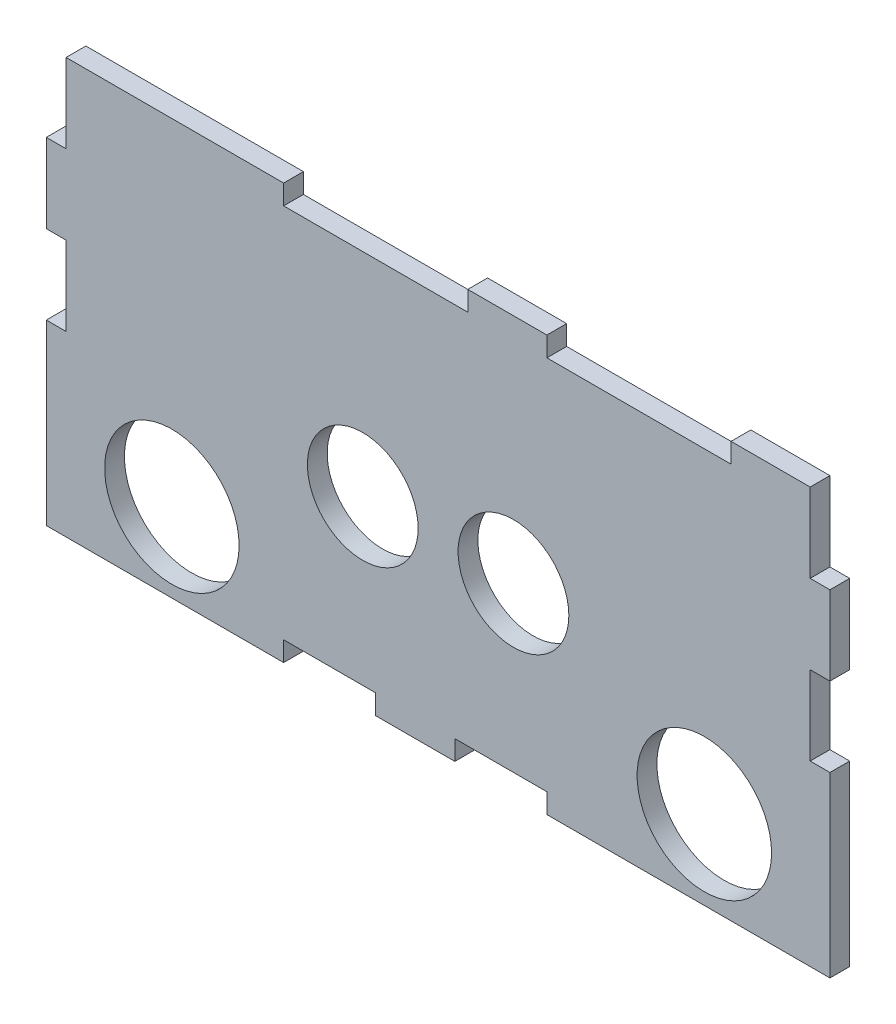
ISO-10303-21;
HEADER;
FILE_DESCRIPTION(('STEP AP214'),'2;1');
FILE_NAME('part.step','',(''),(''),'','','');
FILE_SCHEMA(('AUTOMOTIVE_DESIGN { 1 0 10303 214 1 1 1 1 }'));
ENDSEC;
DATA;
#1=APPLICATION_CONTEXT('core data for automotive mechanical design processes');
#2=APPLICATION_PROTOCOL_DEFINITION('international standard','automotive_design',2000,#1);
#3=PRODUCT_CONTEXT('',#1,'mechanical');
#4=PRODUCT('Part','Part','',(#3));
#5=PRODUCT_RELATED_PRODUCT_CATEGORY('part','',(#4));
#6=PRODUCT_DEFINITION_FORMATION('','',#4);
#7=PRODUCT_DEFINITION_CONTEXT('part definition',#1,'design');
#8=PRODUCT_DEFINITION('design','',#6,#7);
#9=PRODUCT_DEFINITION_SHAPE('','',#8);
#10=(LENGTH_UNIT() NAMED_UNIT(*) SI_UNIT(.MILLI.,.METRE.));
#11=(NAMED_UNIT(*) PLANE_ANGLE_UNIT() SI_UNIT($,.RADIAN.));
#12=(NAMED_UNIT(*) SI_UNIT($,.STERADIAN.) SOLID_ANGLE_UNIT());
#13=UNCERTAINTY_MEASURE_WITH_UNIT(LENGTH_MEASURE(1.E-05),#10,'distance_accuracy_value','');
#14=(GEOMETRIC_REPRESENTATION_CONTEXT(3) GLOBAL_UNCERTAINTY_ASSIGNED_CONTEXT((#13)) GLOBAL_UNIT_ASSIGNED_CONTEXT((#10,
#11,#12)) REPRESENTATION_CONTEXT('',''));
#15=CARTESIAN_POINT('',(0.,0.,0.));
#16=DIRECTION('',(0.,0.,1.));
#17=DIRECTION('',(1.,0.,0.));
#18=AXIS2_PLACEMENT_3D('',#15,#16,#17);
#19=CARTESIAN_POINT('',(0.,0.,5.));
#20=DIRECTION('',(0.,0.,1.));
#21=DIRECTION('',(1.,0.,0.));
#22=AXIS2_PLACEMENT_3D('',#19,#20,#21);
#23=PLANE('',#22);
#24=CARTESIAN_POINT('',(118.11,46.3812888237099,5.));
#25=DIRECTION('',(0.,0.,1.));
#26=DIRECTION('',(1.,0.,0.));
#27=AXIS2_PLACEMENT_3D('',#24,#25,#26);
#28=CIRCLE('',#27,14.);
#29=CARTESIAN_POINT('',(132.11,46.3812888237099,5.));
#30=VERTEX_POINT('',#29);
#31=EDGE_CURVE('E557',#30,#30,#28,.T.);
#32=ORIENTED_EDGE('',*,*,#31,.F.);
#33=EDGE_LOOP('',(#32));
#34=FACE_BOUND('',#33,.T.);
#35=CARTESIAN_POINT('',(31.75,20.,5.));
#36=DIRECTION('',(0.,0.,1.));
#37=DIRECTION('',(1.,0.,0.));
#38=AXIS2_PLACEMENT_3D('',#35,#36,#37);
#39=CIRCLE('',#38,17.);
#40=CARTESIAN_POINT('',(48.75,20.,5.));
#41=VERTEX_POINT('',#40);
#42=EDGE_CURVE('E284',#41,#41,#39,.T.);
#43=ORIENTED_EDGE('',*,*,#42,.F.);
#44=EDGE_LOOP('',(#43));
#45=FACE_BOUND('',#44,.T.);
#46=DIRECTION('',(1.,0.,0.));
#47=VECTOR('',#46,1.);
#48=CARTESIAN_POINT('',(0.,0.,5.));
#49=LINE('',#48,#47);
#50=CARTESIAN_POINT('',(0.,0.,5.));
#51=VERTEX_POINT('',#50);
#52=CARTESIAN_POINT('',(60.,0.,5.));
#53=VERTEX_POINT('',#52);
#54=EDGE_CURVE('E343',#51,#53,#49,.T.);
#55=ORIENTED_EDGE('',*,*,#54,.T.);
#56=DIRECTION('',(0.,1.,0.));
#57=VECTOR('',#56,1.);
#58=CARTESIAN_POINT('',(60.,0.,5.));
#59=LINE('',#58,#57);
#60=CARTESIAN_POINT('',(60.,5.,5.));
#61=VERTEX_POINT('',#60);
#62=EDGE_CURVE('E171',#53,#61,#59,.T.);
#63=ORIENTED_EDGE('',*,*,#62,.T.);
#64=DIRECTION('',(1.,0.,0.));
#65=VECTOR('',#64,1.);
#66=CARTESIAN_POINT('',(60.,5.,5.));
#67=LINE('',#66,#65);
#68=CARTESIAN_POINT('',(83.28,5.,5.));
#69=VERTEX_POINT('',#68);
#70=EDGE_CURVE('E430',#61,#69,#67,.T.);
#71=ORIENTED_EDGE('',*,*,#70,.T.);
#72=DIRECTION('',(0.,-1.,0.));
#73=VECTOR('',#72,1.);
#74=CARTESIAN_POINT('',(83.28,5.,5.));
#75=LINE('',#74,#73);
#76=CARTESIAN_POINT('',(83.28,0.,5.));
#77=VERTEX_POINT('',#76);
#78=EDGE_CURVE('E449',#69,#77,#75,.T.);
#79=ORIENTED_EDGE('',*,*,#78,.T.);
#80=DIRECTION('',(1.,0.,0.));
#81=VECTOR('',#80,1.);
#82=CARTESIAN_POINT('',(83.28,0.,5.));
#83=LINE('',#82,#81);
#84=CARTESIAN_POINT('',(103.28,0.,5.));
#85=VERTEX_POINT('',#84);
#86=EDGE_CURVE('E446',#77,#85,#83,.T.);
#87=ORIENTED_EDGE('',*,*,#86,.T.);
#88=DIRECTION('',(0.,1.,0.));
#89=VECTOR('',#88,1.);
#90=CARTESIAN_POINT('',(103.28,0.,5.));
#91=LINE('',#90,#89);
#92=CARTESIAN_POINT('',(103.28,5.,5.));
#93=VERTEX_POINT('',#92);
#94=EDGE_CURVE('E448',#85,#93,#91,.T.);
#95=ORIENTED_EDGE('',*,*,#94,.T.);
#96=DIRECTION('',(1.,0.,0.));
#97=VECTOR('',#96,1.);
#98=CARTESIAN_POINT('',(103.28,5.,5.));
#99=LINE('',#98,#97);
#100=CARTESIAN_POINT('',(126.56,5.,5.));
#101=VERTEX_POINT('',#100);
#102=EDGE_CURVE('E451',#93,#101,#99,.T.);
#103=ORIENTED_EDGE('',*,*,#102,.T.);
#104=DIRECTION('',(0.,-1.,0.));
#105=VECTOR('',#104,1.);
#106=CARTESIAN_POINT('',(126.56,5.,5.));
#107=LINE('',#106,#105);
#108=CARTESIAN_POINT('',(126.56,0.,5.));
#109=VERTEX_POINT('',#108);
#110=EDGE_CURVE('E457',#101,#109,#107,.T.);
#111=ORIENTED_EDGE('',*,*,#110,.T.);
#112=DIRECTION('',(1.,0.,0.));
#113=VECTOR('',#112,1.);
#114=CARTESIAN_POINT('',(126.56,0.,5.));
#115=LINE('',#114,#113);
#116=CARTESIAN_POINT('',(198.12,0.,5.));
#117=VERTEX_POINT('',#116);
#118=EDGE_CURVE('E459',#109,#117,#115,.T.);
#119=ORIENTED_EDGE('',*,*,#118,.T.);
#120=DIRECTION('',(0.,1.,0.));
#121=VECTOR('',#120,1.);
#122=CARTESIAN_POINT('',(198.12,45.,5.));
#123=LINE('',#122,#121);
#124=CARTESIAN_POINT('',(198.12,45.,5.));
#125=VERTEX_POINT('',#124);
#126=EDGE_CURVE('E461',#117,#125,#123,.T.);
#127=ORIENTED_EDGE('',*,*,#126,.T.);
#128=DIRECTION('',(-1.,0.,0.));
#129=VECTOR('',#128,1.);
#130=CARTESIAN_POINT('',(193.12,45.,5.));
#131=LINE('',#130,#129);
#132=CARTESIAN_POINT('',(193.12,45.,5.));
#133=VERTEX_POINT('',#132);
#134=EDGE_CURVE('E463',#125,#133,#131,.T.);
#135=ORIENTED_EDGE('',*,*,#134,.T.);
#136=DIRECTION('',(0.,1.,0.));
#137=VECTOR('',#136,1.);
#138=CARTESIAN_POINT('',(193.12,65.,5.));
#139=LINE('',#138,#137);
#140=CARTESIAN_POINT('',(193.12,65.,5.));
#141=VERTEX_POINT('',#140);
#142=EDGE_CURVE('E465',#133,#141,#139,.T.);
#143=ORIENTED_EDGE('',*,*,#142,.T.);
#144=DIRECTION('',(1.,0.,0.));
#145=VECTOR('',#144,1.);
#146=CARTESIAN_POINT('',(198.12,65.,5.));
#147=LINE('',#146,#145);
#148=CARTESIAN_POINT('',(198.12,65.,5.));
#149=VERTEX_POINT('',#148);
#150=EDGE_CURVE('E467',#141,#149,#147,.T.);
#151=ORIENTED_EDGE('',*,*,#150,.T.);
#152=DIRECTION('',(0.,1.,0.));
#153=VECTOR('',#152,1.);
#154=CARTESIAN_POINT('',(198.12,85.,5.));
#155=LINE('',#154,#153);
#156=CARTESIAN_POINT('',(198.12,85.,5.));
#157=VERTEX_POINT('',#156);
#158=EDGE_CURVE('E469',#149,#157,#155,.T.);
#159=ORIENTED_EDGE('',*,*,#158,.T.);
#160=DIRECTION('',(-1.,0.,0.));
#161=VECTOR('',#160,1.);
#162=CARTESIAN_POINT('',(193.12,85.,5.));
#163=LINE('',#162,#161);
#164=CARTESIAN_POINT('',(193.12,85.,5.));
#165=VERTEX_POINT('',#164);
#166=EDGE_CURVE('E471',#157,#165,#163,.T.);
#167=ORIENTED_EDGE('',*,*,#166,.T.);
#168=DIRECTION('',(0.,1.,0.));
#169=VECTOR('',#168,1.);
#170=CARTESIAN_POINT('',(193.12,105.,5.));
#171=LINE('',#170,#169);
#172=CARTESIAN_POINT('',(193.12,105.,5.));
#173=VERTEX_POINT('',#172);
#174=EDGE_CURVE('E473',#165,#173,#171,.T.);
#175=ORIENTED_EDGE('',*,*,#174,.T.);
#176=DIRECTION('',(-1.,0.,0.));
#177=VECTOR('',#176,1.);
#178=CARTESIAN_POINT('',(173.12,105.,5.));
#179=LINE('',#178,#177);
#180=CARTESIAN_POINT('',(173.12,105.,5.));
#181=VERTEX_POINT('',#180);
#182=EDGE_CURVE('E475',#173,#181,#179,.T.);
#183=ORIENTED_EDGE('',*,*,#182,.T.);
#184=DIRECTION('',(0.,-1.,0.));
#185=VECTOR('',#184,1.);
#186=CARTESIAN_POINT('',(173.12,100.,5.));
#187=LINE('',#186,#185);
#188=CARTESIAN_POINT('',(173.12,100.,5.));
#189=VERTEX_POINT('',#188);
#190=EDGE_CURVE('E477',#181,#189,#187,.T.);
#191=ORIENTED_EDGE('',*,*,#190,.T.);
#192=DIRECTION('',(-1.,0.,0.));
#193=VECTOR('',#192,1.);
#194=CARTESIAN_POINT('',(126.56,100.,5.));
#195=LINE('',#194,#193);
#196=CARTESIAN_POINT('',(126.56,100.,5.));
#197=VERTEX_POINT('',#196);
#198=EDGE_CURVE('E479',#189,#197,#195,.T.);
#199=ORIENTED_EDGE('',*,*,#198,.T.);
#200=DIRECTION('',(0.,1.,0.));
#201=VECTOR('',#200,1.);
#202=CARTESIAN_POINT('',(126.56,105.,5.));
#203=LINE('',#202,#201);
#204=CARTESIAN_POINT('',(126.56,105.,5.));
#205=VERTEX_POINT('',#204);
#206=EDGE_CURVE('E481',#197,#205,#203,.T.);
#207=ORIENTED_EDGE('',*,*,#206,.T.);
#208=DIRECTION('',(-1.,0.,0.));
#209=VECTOR('',#208,1.);
#210=CARTESIAN_POINT('',(106.56,105.,5.));
#211=LINE('',#210,#209);
#212=CARTESIAN_POINT('',(106.56,105.,5.));
#213=VERTEX_POINT('',#212);
#214=EDGE_CURVE('E483',#205,#213,#211,.T.);
#215=ORIENTED_EDGE('',*,*,#214,.T.);
#216=DIRECTION('',(0.,-1.,0.));
#217=VECTOR('',#216,1.);
#218=CARTESIAN_POINT('',(106.56,100.,5.));
#219=LINE('',#218,#217);
#220=CARTESIAN_POINT('',(106.56,100.,5.));
#221=VERTEX_POINT('',#220);
#222=EDGE_CURVE('E485',#213,#221,#219,.T.);
#223=ORIENTED_EDGE('',*,*,#222,.T.);
#224=DIRECTION('',(-1.,0.,0.));
#225=VECTOR('',#224,1.);
#226=CARTESIAN_POINT('',(60.,100.,5.));
#227=LINE('',#226,#225);
#228=CARTESIAN_POINT('',(60.,100.,5.));
#229=VERTEX_POINT('',#228);
#230=EDGE_CURVE('E487',#221,#229,#227,.T.);
#231=ORIENTED_EDGE('',*,*,#230,.T.);
#232=DIRECTION('',(0.,1.,0.));
#233=VECTOR('',#232,1.);
#234=CARTESIAN_POINT('',(60.,105.,5.));
#235=LINE('',#234,#233);
#236=CARTESIAN_POINT('',(60.,105.,5.));
#237=VERTEX_POINT('',#236);
#238=EDGE_CURVE('E489',#229,#237,#235,.T.);
#239=ORIENTED_EDGE('',*,*,#238,.T.);
#240=DIRECTION('',(-1.,0.,0.));
#241=VECTOR('',#240,1.);
#242=CARTESIAN_POINT('',(5.,105.,5.));
#243=LINE('',#242,#241);
#244=CARTESIAN_POINT('',(5.,105.,5.));
#245=VERTEX_POINT('',#244);
#246=EDGE_CURVE('E491',#237,#245,#243,.T.);
#247=ORIENTED_EDGE('',*,*,#246,.T.);
#248=DIRECTION('',(0.,-1.,0.));
#249=VECTOR('',#248,1.);
#250=CARTESIAN_POINT('',(5.,85.,5.));
#251=LINE('',#250,#249);
#252=CARTESIAN_POINT('',(5.,85.,5.));
#253=VERTEX_POINT('',#252);
#254=EDGE_CURVE('E493',#245,#253,#251,.T.);
#255=ORIENTED_EDGE('',*,*,#254,.T.);
#256=DIRECTION('',(-1.,0.,0.));
#257=VECTOR('',#256,1.);
#258=CARTESIAN_POINT('',(0.,85.,5.));
#259=LINE('',#258,#257);
#260=CARTESIAN_POINT('',(0.,85.,5.));
#261=VERTEX_POINT('',#260);
#262=EDGE_CURVE('E495',#253,#261,#259,.T.);
#263=ORIENTED_EDGE('',*,*,#262,.T.);
#264=DIRECTION('',(0.,-1.,0.));
#265=VECTOR('',#264,1.);
#266=CARTESIAN_POINT('',(0.,65.,5.));
#267=LINE('',#266,#265);
#268=CARTESIAN_POINT('',(0.,65.,5.));
#269=VERTEX_POINT('',#268);
#270=EDGE_CURVE('E497',#261,#269,#267,.T.);
#271=ORIENTED_EDGE('',*,*,#270,.T.);
#272=DIRECTION('',(1.,0.,0.));
#273=VECTOR('',#272,1.);
#274=CARTESIAN_POINT('',(5.,65.,5.));
#275=LINE('',#274,#273);
#276=CARTESIAN_POINT('',(5.,65.,5.));
#277=VERTEX_POINT('',#276);
#278=EDGE_CURVE('E262',#269,#277,#275,.T.);
#279=ORIENTED_EDGE('',*,*,#278,.T.);
#280=DIRECTION('',(0.,-1.,0.));
#281=VECTOR('',#280,1.);
#282=CARTESIAN_POINT('',(5.,45.,5.));
#283=LINE('',#282,#281);
#284=CARTESIAN_POINT('',(5.,45.,5.));
#285=VERTEX_POINT('',#284);
#286=EDGE_CURVE('E256',#277,#285,#283,.T.);
#287=ORIENTED_EDGE('',*,*,#286,.T.);
#288=DIRECTION('',(-1.,0.,0.));
#289=VECTOR('',#288,1.);
#290=CARTESIAN_POINT('',(0.,45.,5.));
#291=LINE('',#290,#289);
#292=CARTESIAN_POINT('',(0.,45.,5.));
#293=VERTEX_POINT('',#292);
#294=EDGE_CURVE('E260',#285,#293,#291,.T.);
#295=ORIENTED_EDGE('',*,*,#294,.T.);
#296=DIRECTION('',(0.,-1.,0.));
#297=VECTOR('',#296,1.);
#298=CARTESIAN_POINT('',(0.,0.,5.));
#299=LINE('',#298,#297);
#300=EDGE_CURVE('E56',#293,#51,#299,.T.);
#301=ORIENTED_EDGE('',*,*,#300,.T.);
#302=EDGE_LOOP('',(#55,#63,#71,#79,#87,#95,#103,#111,#119,#127,#135,#143,#151,#159,#167,#175,
#183,#191,#199,#207,#215,#223,#231,#239,#247,#255,#263,#271,#279,#287,#295,#301));
#303=FACE_BOUND('',#302,.T.);
#304=CARTESIAN_POINT('',(80.01,46.3812888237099,5.));
#305=DIRECTION('',(0.,0.,1.));
#306=DIRECTION('',(1.,0.,0.));
#307=AXIS2_PLACEMENT_3D('',#304,#305,#306);
#308=CIRCLE('',#307,14.);
#309=CARTESIAN_POINT('',(94.01,46.3812888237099,5.));
#310=VERTEX_POINT('',#309);
#311=EDGE_CURVE('E563',#310,#310,#308,.T.);
#312=ORIENTED_EDGE('',*,*,#311,.F.);
#313=EDGE_LOOP('',(#312));
#314=FACE_BOUND('',#313,.T.);
#315=CARTESIAN_POINT('',(166.37,20.,5.));
#316=DIRECTION('',(0.,0.,1.));
#317=DIRECTION('',(1.,0.,0.));
#318=AXIS2_PLACEMENT_3D('',#315,#316,#317);
#319=CIRCLE('',#318,17.);
#320=CARTESIAN_POINT('',(183.37,20.,5.));
#321=VERTEX_POINT('',#320);
#322=EDGE_CURVE('E548',#321,#321,#319,.T.);
#323=ORIENTED_EDGE('',*,*,#322,.F.);
#324=EDGE_LOOP('',(#323));
#325=FACE_BOUND('',#324,.T.);
#326=ADVANCED_FACE('F39',(#34,#45,#303,#314,#325),#23,.T.);
#327=CARTESIAN_POINT('',(0.,0.,0.));
#328=DIRECTION('',(0.,0.,1.));
#329=DIRECTION('',(1.,0.,0.));
#330=AXIS2_PLACEMENT_3D('',#327,#328,#329);
#331=PLANE('',#330);
#332=DIRECTION('',(1.,0.,0.));
#333=VECTOR('',#332,1.);
#334=CARTESIAN_POINT('',(0.,0.,0.));
#335=LINE('',#334,#333);
#336=CARTESIAN_POINT('',(0.,0.,0.));
#337=VERTEX_POINT('',#336);
#338=CARTESIAN_POINT('',(60.,0.,0.));
#339=VERTEX_POINT('',#338);
#340=EDGE_CURVE('E280',#337,#339,#335,.T.);
#341=ORIENTED_EDGE('',*,*,#340,.F.);
#342=DIRECTION('',(0.,-1.,0.));
#343=VECTOR('',#342,1.);
#344=CARTESIAN_POINT('',(0.,0.,0.));
#345=LINE('',#344,#343);
#346=CARTESIAN_POINT('',(0.,45.,0.));
#347=VERTEX_POINT('',#346);
#348=EDGE_CURVE('E163',#347,#337,#345,.T.);
#349=ORIENTED_EDGE('',*,*,#348,.F.);
#350=DIRECTION('',(-1.,0.,0.));
#351=VECTOR('',#350,1.);
#352=CARTESIAN_POINT('',(0.,45.,0.));
#353=LINE('',#352,#351);
#354=CARTESIAN_POINT('',(5.,45.,0.));
#355=VERTEX_POINT('',#354);
#356=EDGE_CURVE('E157',#355,#347,#353,.T.);
#357=ORIENTED_EDGE('',*,*,#356,.F.);
#358=DIRECTION('',(0.,-1.,0.));
#359=VECTOR('',#358,1.);
#360=CARTESIAN_POINT('',(5.,45.,0.));
#361=LINE('',#360,#359);
#362=CARTESIAN_POINT('',(5.,65.,0.));
#363=VERTEX_POINT('',#362);
#364=EDGE_CURVE('E270',#363,#355,#361,.T.);
#365=ORIENTED_EDGE('',*,*,#364,.F.);
#366=DIRECTION('',(1.,0.,0.));
#367=VECTOR('',#366,1.);
#368=CARTESIAN_POINT('',(5.,65.,0.));
#369=LINE('',#368,#367);
#370=CARTESIAN_POINT('',(0.,65.,0.));
#371=VERTEX_POINT('',#370);
#372=EDGE_CURVE('E338',#371,#363,#369,.T.);
#373=ORIENTED_EDGE('',*,*,#372,.F.);
#374=DIRECTION('',(0.,-1.,0.));
#375=VECTOR('',#374,1.);
#376=CARTESIAN_POINT('',(0.,65.,0.));
#377=LINE('',#376,#375);
#378=CARTESIAN_POINT('',(0.,85.,0.));
#379=VERTEX_POINT('',#378);
#380=EDGE_CURVE('E336',#379,#371,#377,.T.);
#381=ORIENTED_EDGE('',*,*,#380,.F.);
#382=DIRECTION('',(-1.,0.,0.));
#383=VECTOR('',#382,1.);
#384=CARTESIAN_POINT('',(0.,85.,0.));
#385=LINE('',#384,#383);
#386=CARTESIAN_POINT('',(5.,85.,0.));
#387=VERTEX_POINT('',#386);
#388=EDGE_CURVE('E334',#387,#379,#385,.T.);
#389=ORIENTED_EDGE('',*,*,#388,.F.);
#390=DIRECTION('',(0.,-1.,0.));
#391=VECTOR('',#390,1.);
#392=CARTESIAN_POINT('',(5.,85.,0.));
#393=LINE('',#392,#391);
#394=CARTESIAN_POINT('',(5.,105.,0.));
#395=VERTEX_POINT('',#394);
#396=EDGE_CURVE('E332',#395,#387,#393,.T.);
#397=ORIENTED_EDGE('',*,*,#396,.F.);
#398=DIRECTION('',(-1.,0.,0.));
#399=VECTOR('',#398,1.);
#400=CARTESIAN_POINT('',(5.,105.,0.));
#401=LINE('',#400,#399);
#402=CARTESIAN_POINT('',(60.,105.,0.));
#403=VERTEX_POINT('',#402);
#404=EDGE_CURVE('E330',#403,#395,#401,.T.);
#405=ORIENTED_EDGE('',*,*,#404,.F.);
#406=DIRECTION('',(0.,1.,0.));
#407=VECTOR('',#406,1.);
#408=CARTESIAN_POINT('',(60.,105.,0.));
#409=LINE('',#408,#407);
#410=CARTESIAN_POINT('',(60.,100.,0.));
#411=VERTEX_POINT('',#410);
#412=EDGE_CURVE('E328',#411,#403,#409,.T.);
#413=ORIENTED_EDGE('',*,*,#412,.F.);
#414=DIRECTION('',(-1.,0.,0.));
#415=VECTOR('',#414,1.);
#416=CARTESIAN_POINT('',(60.,100.,0.));
#417=LINE('',#416,#415);
#418=CARTESIAN_POINT('',(106.56,100.,0.));
#419=VERTEX_POINT('',#418);
#420=EDGE_CURVE('E326',#419,#411,#417,.T.);
#421=ORIENTED_EDGE('',*,*,#420,.F.);
#422=DIRECTION('',(0.,-1.,0.));
#423=VECTOR('',#422,1.);
#424=CARTESIAN_POINT('',(106.56,100.,0.));
#425=LINE('',#424,#423);
#426=CARTESIAN_POINT('',(106.56,105.,0.));
#427=VERTEX_POINT('',#426);
#428=EDGE_CURVE('E324',#427,#419,#425,.T.);
#429=ORIENTED_EDGE('',*,*,#428,.F.);
#430=DIRECTION('',(-1.,0.,0.));
#431=VECTOR('',#430,1.);
#432=CARTESIAN_POINT('',(106.56,105.,0.));
#433=LINE('',#432,#431);
#434=CARTESIAN_POINT('',(126.56,105.,0.));
#435=VERTEX_POINT('',#434);
#436=EDGE_CURVE('E322',#435,#427,#433,.T.);
#437=ORIENTED_EDGE('',*,*,#436,.F.);
#438=DIRECTION('',(0.,1.,0.));
#439=VECTOR('',#438,1.);
#440=CARTESIAN_POINT('',(126.56,105.,0.));
#441=LINE('',#440,#439);
#442=CARTESIAN_POINT('',(126.56,100.,0.));
#443=VERTEX_POINT('',#442);
#444=EDGE_CURVE('E320',#443,#435,#441,.T.);
#445=ORIENTED_EDGE('',*,*,#444,.F.);
#446=DIRECTION('',(-1.,0.,0.));
#447=VECTOR('',#446,1.);
#448=CARTESIAN_POINT('',(126.56,100.,0.));
#449=LINE('',#448,#447);
#450=CARTESIAN_POINT('',(173.12,100.,0.));
#451=VERTEX_POINT('',#450);
#452=EDGE_CURVE('E318',#451,#443,#449,.T.);
#453=ORIENTED_EDGE('',*,*,#452,.F.);
#454=DIRECTION('',(0.,-1.,0.));
#455=VECTOR('',#454,1.);
#456=CARTESIAN_POINT('',(173.12,100.,0.));
#457=LINE('',#456,#455);
#458=CARTESIAN_POINT('',(173.12,105.,0.));
#459=VERTEX_POINT('',#458);
#460=EDGE_CURVE('E316',#459,#451,#457,.T.);
#461=ORIENTED_EDGE('',*,*,#460,.F.);
#462=DIRECTION('',(-1.,0.,0.));
#463=VECTOR('',#462,1.);
#464=CARTESIAN_POINT('',(173.12,105.,0.));
#465=LINE('',#464,#463);
#466=CARTESIAN_POINT('',(193.12,105.,0.));
#467=VERTEX_POINT('',#466);
#468=EDGE_CURVE('E314',#467,#459,#465,.T.);
#469=ORIENTED_EDGE('',*,*,#468,.F.);
#470=DIRECTION('',(0.,1.,0.));
#471=VECTOR('',#470,1.);
#472=CARTESIAN_POINT('',(193.12,105.,0.));
#473=LINE('',#472,#471);
#474=CARTESIAN_POINT('',(193.12,85.,0.));
#475=VERTEX_POINT('',#474);
#476=EDGE_CURVE('E312',#475,#467,#473,.T.);
#477=ORIENTED_EDGE('',*,*,#476,.F.);
#478=DIRECTION('',(-1.,0.,0.));
#479=VECTOR('',#478,1.);
#480=CARTESIAN_POINT('',(193.12,85.,0.));
#481=LINE('',#480,#479);
#482=CARTESIAN_POINT('',(198.12,85.,0.));
#483=VERTEX_POINT('',#482);
#484=EDGE_CURVE('E310',#483,#475,#481,.T.);
#485=ORIENTED_EDGE('',*,*,#484,.F.);
#486=DIRECTION('',(0.,1.,0.));
#487=VECTOR('',#486,1.);
#488=CARTESIAN_POINT('',(198.12,85.,0.));
#489=LINE('',#488,#487);
#490=CARTESIAN_POINT('',(198.12,65.,0.));
#491=VERTEX_POINT('',#490);
#492=EDGE_CURVE('E308',#491,#483,#489,.T.);
#493=ORIENTED_EDGE('',*,*,#492,.F.);
#494=DIRECTION('',(1.,0.,0.));
#495=VECTOR('',#494,1.);
#496=CARTESIAN_POINT('',(198.12,65.,0.));
#497=LINE('',#496,#495);
#498=CARTESIAN_POINT('',(193.12,65.,0.));
#499=VERTEX_POINT('',#498);
#500=EDGE_CURVE('E306',#499,#491,#497,.T.);
#501=ORIENTED_EDGE('',*,*,#500,.F.);
#502=DIRECTION('',(0.,1.,0.));
#503=VECTOR('',#502,1.);
#504=CARTESIAN_POINT('',(193.12,65.,0.));
#505=LINE('',#504,#503);
#506=CARTESIAN_POINT('',(193.12,45.,0.));
#507=VERTEX_POINT('',#506);
#508=EDGE_CURVE('E304',#507,#499,#505,.T.);
#509=ORIENTED_EDGE('',*,*,#508,.F.);
#510=DIRECTION('',(-1.,0.,0.));
#511=VECTOR('',#510,1.);
#512=CARTESIAN_POINT('',(193.12,45.,0.));
#513=LINE('',#512,#511);
#514=CARTESIAN_POINT('',(198.12,45.,0.));
#515=VERTEX_POINT('',#514);
#516=EDGE_CURVE('E302',#515,#507,#513,.T.);
#517=ORIENTED_EDGE('',*,*,#516,.F.);
#518=DIRECTION('',(0.,1.,0.));
#519=VECTOR('',#518,1.);
#520=CARTESIAN_POINT('',(198.12,45.,0.));
#521=LINE('',#520,#519);
#522=CARTESIAN_POINT('',(198.12,0.,0.));
#523=VERTEX_POINT('',#522);
#524=EDGE_CURVE('E300',#523,#515,#521,.T.);
#525=ORIENTED_EDGE('',*,*,#524,.F.);
#526=DIRECTION('',(1.,0.,0.));
#527=VECTOR('',#526,1.);
#528=CARTESIAN_POINT('',(126.56,0.,0.));
#529=LINE('',#528,#527);
#530=CARTESIAN_POINT('',(126.56,0.,0.));
#531=VERTEX_POINT('',#530);
#532=EDGE_CURVE('E298',#531,#523,#529,.T.);
#533=ORIENTED_EDGE('',*,*,#532,.F.);
#534=DIRECTION('',(0.,-1.,0.));
#535=VECTOR('',#534,1.);
#536=CARTESIAN_POINT('',(126.56,5.,0.));
#537=LINE('',#536,#535);
#538=CARTESIAN_POINT('',(126.56,5.,0.));
#539=VERTEX_POINT('',#538);
#540=EDGE_CURVE('E296',#539,#531,#537,.T.);
#541=ORIENTED_EDGE('',*,*,#540,.F.);
#542=DIRECTION('',(1.,0.,0.));
#543=VECTOR('',#542,1.);
#544=CARTESIAN_POINT('',(103.28,5.,0.));
#545=LINE('',#544,#543);
#546=CARTESIAN_POINT('',(103.28,5.,0.));
#547=VERTEX_POINT('',#546);
#548=EDGE_CURVE('E294',#547,#539,#545,.T.);
#549=ORIENTED_EDGE('',*,*,#548,.F.);
#550=DIRECTION('',(0.,1.,0.));
#551=VECTOR('',#550,1.);
#552=CARTESIAN_POINT('',(103.28,0.,0.));
#553=LINE('',#552,#551);
#554=CARTESIAN_POINT('',(103.28,0.,0.));
#555=VERTEX_POINT('',#554);
#556=EDGE_CURVE('E292',#555,#547,#553,.T.);
#557=ORIENTED_EDGE('',*,*,#556,.F.);
#558=DIRECTION('',(1.,0.,0.));
#559=VECTOR('',#558,1.);
#560=CARTESIAN_POINT('',(83.28,0.,0.));
#561=LINE('',#560,#559);
#562=CARTESIAN_POINT('',(83.28,0.,0.));
#563=VERTEX_POINT('',#562);
#564=EDGE_CURVE('E290',#563,#555,#561,.T.);
#565=ORIENTED_EDGE('',*,*,#564,.F.);
#566=DIRECTION('',(0.,-1.,0.));
#567=VECTOR('',#566,1.);
#568=CARTESIAN_POINT('',(83.28,5.,0.));
#569=LINE('',#568,#567);
#570=CARTESIAN_POINT('',(83.28,5.,0.));
#571=VERTEX_POINT('',#570);
#572=EDGE_CURVE('E288',#571,#563,#569,.T.);
#573=ORIENTED_EDGE('',*,*,#572,.F.);
#574=DIRECTION('',(1.,0.,0.));
#575=VECTOR('',#574,1.);
#576=CARTESIAN_POINT('',(60.,5.,0.));
#577=LINE('',#576,#575);
#578=CARTESIAN_POINT('',(60.,5.,0.));
#579=VERTEX_POINT('',#578);
#580=EDGE_CURVE('E286',#579,#571,#577,.T.);
#581=ORIENTED_EDGE('',*,*,#580,.F.);
#582=DIRECTION('',(0.,1.,0.));
#583=VECTOR('',#582,1.);
#584=CARTESIAN_POINT('',(60.,0.,0.));
#585=LINE('',#584,#583);
#586=EDGE_CURVE('E283',#339,#579,#585,.T.);
#587=ORIENTED_EDGE('',*,*,#586,.F.);
#588=EDGE_LOOP('',(#341,#349,#357,#365,#373,#381,#389,#397,#405,#413,#421,#429,#437,#445,#453,
#461,#469,#477,#485,#493,#501,#509,#517,#525,#533,#541,#549,#557,#565,#573,#581,#587));
#589=FACE_BOUND('',#588,.T.);
#590=CARTESIAN_POINT('',(31.75,20.,0.));
#591=DIRECTION('',(0.,0.,1.));
#592=DIRECTION('',(1.,0.,0.));
#593=AXIS2_PLACEMENT_3D('',#590,#591,#592);
#594=CIRCLE('',#593,17.);
#595=CARTESIAN_POINT('',(48.75,20.,0.));
#596=VERTEX_POINT('',#595);
#597=EDGE_CURVE('E566',#596,#596,#594,.T.);
#598=ORIENTED_EDGE('',*,*,#597,.T.);
#599=EDGE_LOOP('',(#598));
#600=FACE_BOUND('',#599,.T.);
#601=CARTESIAN_POINT('',(80.01,46.3812888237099,0.));
#602=DIRECTION('',(0.,0.,1.));
#603=DIRECTION('',(1.,0.,0.));
#604=AXIS2_PLACEMENT_3D('',#601,#602,#603);
#605=CIRCLE('',#604,14.);
#606=CARTESIAN_POINT('',(94.01,46.3812888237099,0.));
#607=VERTEX_POINT('',#606);
#608=EDGE_CURVE('E560',#607,#607,#605,.T.);
#609=ORIENTED_EDGE('',*,*,#608,.T.);
#610=EDGE_LOOP('',(#609));
#611=FACE_BOUND('',#610,.T.);
#612=CARTESIAN_POINT('',(118.11,46.3812888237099,0.));
#613=DIRECTION('',(0.,0.,1.));
#614=DIRECTION('',(1.,0.,0.));
#615=AXIS2_PLACEMENT_3D('',#612,#613,#614);
#616=CIRCLE('',#615,14.);
#617=CARTESIAN_POINT('',(132.11,46.3812888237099,0.));
#618=VERTEX_POINT('',#617);
#619=EDGE_CURVE('E554',#618,#618,#616,.T.);
#620=ORIENTED_EDGE('',*,*,#619,.T.);
#621=EDGE_LOOP('',(#620));
#622=FACE_BOUND('',#621,.T.);
#623=CARTESIAN_POINT('',(166.37,20.,0.));
#624=DIRECTION('',(0.,0.,1.));
#625=DIRECTION('',(1.,0.,0.));
#626=AXIS2_PLACEMENT_3D('',#623,#624,#625);
#627=CIRCLE('',#626,17.);
#628=CARTESIAN_POINT('',(183.37,20.,0.));
#629=VERTEX_POINT('',#628);
#630=EDGE_CURVE('E551',#629,#629,#627,.T.);
#631=ORIENTED_EDGE('',*,*,#630,.T.);
#632=EDGE_LOOP('',(#631));
#633=FACE_BOUND('',#632,.T.);
#634=ADVANCED_FACE('F434',(#589,#600,#611,#622,#633),#331,.F.);
#635=CARTESIAN_POINT('',(0.,0.,5.));
#636=DIRECTION('',(0.,1.,0.));
#637=DIRECTION('',(0.,0.,1.));
#638=AXIS2_PLACEMENT_3D('',#635,#636,#637);
#639=PLANE('',#638);
#640=ORIENTED_EDGE('',*,*,#340,.T.);
#641=DIRECTION('',(0.,0.,-1.));
#642=VECTOR('',#641,1.);
#643=CARTESIAN_POINT('',(60.,0.,5.));
#644=LINE('',#643,#642);
#645=EDGE_CURVE('E11',#53,#339,#644,.T.);
#646=ORIENTED_EDGE('',*,*,#645,.F.);
#647=ORIENTED_EDGE('',*,*,#54,.F.);
#648=DIRECTION('',(0.,0.,-1.));
#649=VECTOR('',#648,1.);
#650=CARTESIAN_POINT('',(0.,0.,5.));
#651=LINE('',#650,#649);
#652=EDGE_CURVE('E276',#51,#337,#651,.T.);
#653=ORIENTED_EDGE('',*,*,#652,.T.);
#654=EDGE_LOOP('',(#640,#646,#647,#653));
#655=FACE_BOUND('',#654,.T.);
#656=ADVANCED_FACE('F41',(#655),#639,.F.);
#657=CARTESIAN_POINT('',(60.,0.,5.));
#658=DIRECTION('',(-1.,0.,0.));
#659=DIRECTION('',(0.,0.,1.));
#660=AXIS2_PLACEMENT_3D('',#657,#658,#659);
#661=PLANE('',#660);
#662=ORIENTED_EDGE('',*,*,#586,.T.);
#663=DIRECTION('',(0.,0.,-1.));
#664=VECTOR('',#663,1.);
#665=CARTESIAN_POINT('',(60.,5.,5.));
#666=LINE('',#665,#664);
#667=EDGE_CURVE('E48',#61,#579,#666,.T.);
#668=ORIENTED_EDGE('',*,*,#667,.F.);
#669=ORIENTED_EDGE('',*,*,#62,.F.);
#670=ORIENTED_EDGE('',*,*,#645,.T.);
#671=EDGE_LOOP('',(#662,#668,#669,#670));
#672=FACE_BOUND('',#671,.T.);
#673=ADVANCED_FACE('F906',(#672),#661,.F.);
#674=CARTESIAN_POINT('',(60.,5.,5.));
#675=DIRECTION('',(0.,1.,0.));
#676=DIRECTION('',(0.,0.,1.));
#677=AXIS2_PLACEMENT_3D('',#674,#675,#676);
#678=PLANE('',#677);
#679=ORIENTED_EDGE('',*,*,#580,.T.);
#680=DIRECTION('',(0.,0.,-1.));
#681=VECTOR('',#680,1.);
#682=CARTESIAN_POINT('',(83.28,5.,5.));
#683=LINE('',#682,#681);
#684=EDGE_CURVE('E422',#69,#571,#683,.T.);
#685=ORIENTED_EDGE('',*,*,#684,.F.);
#686=ORIENTED_EDGE('',*,*,#70,.F.);
#687=ORIENTED_EDGE('',*,*,#667,.T.);
#688=EDGE_LOOP('',(#679,#685,#686,#687));
#689=FACE_BOUND('',#688,.T.);
#690=ADVANCED_FACE('F428',(#689),#678,.F.);
#691=CARTESIAN_POINT('',(83.28,5.,5.));
#692=DIRECTION('',(1.,0.,0.));
#693=DIRECTION('',(0.,0.,-1.));
#694=AXIS2_PLACEMENT_3D('',#691,#692,#693);
#695=PLANE('',#694);
#696=ORIENTED_EDGE('',*,*,#572,.T.);
#697=DIRECTION('',(0.,0.,-1.));
#698=VECTOR('',#697,1.);
#699=CARTESIAN_POINT('',(83.28,0.,5.));
#700=LINE('',#699,#698);
#701=EDGE_CURVE('E419',#77,#563,#700,.T.);
#702=ORIENTED_EDGE('',*,*,#701,.F.);
#703=ORIENTED_EDGE('',*,*,#78,.F.);
#704=ORIENTED_EDGE('',*,*,#684,.T.);
#705=EDGE_LOOP('',(#696,#702,#703,#704));
#706=FACE_BOUND('',#705,.T.);
#707=ADVANCED_FACE('F440',(#706),#695,.F.);
#708=CARTESIAN_POINT('',(83.28,0.,5.));
#709=DIRECTION('',(0.,1.,0.));
#710=DIRECTION('',(0.,0.,1.));
#711=AXIS2_PLACEMENT_3D('',#708,#709,#710);
#712=PLANE('',#711);
#713=ORIENTED_EDGE('',*,*,#564,.T.);
#714=DIRECTION('',(0.,0.,-1.));
#715=VECTOR('',#714,1.);
#716=CARTESIAN_POINT('',(103.28,0.,5.));
#717=LINE('',#716,#715);
#718=EDGE_CURVE('E416',#85,#555,#717,.T.);
#719=ORIENTED_EDGE('',*,*,#718,.F.);
#720=ORIENTED_EDGE('',*,*,#86,.F.);
#721=ORIENTED_EDGE('',*,*,#701,.T.);
#722=EDGE_LOOP('',(#713,#719,#720,#721));
#723=FACE_BOUND('',#722,.T.);
#724=ADVANCED_FACE('F444',(#723),#712,.F.);
#725=CARTESIAN_POINT('',(103.28,0.,5.));
#726=DIRECTION('',(-1.,0.,0.));
#727=DIRECTION('',(0.,0.,1.));
#728=AXIS2_PLACEMENT_3D('',#725,#726,#727);
#729=PLANE('',#728);
#730=ORIENTED_EDGE('',*,*,#556,.T.);
#731=DIRECTION('',(0.,0.,-1.));
#732=VECTOR('',#731,1.);
#733=CARTESIAN_POINT('',(103.28,5.,5.));
#734=LINE('',#733,#732);
#735=EDGE_CURVE('E413',#93,#547,#734,.T.);
#736=ORIENTED_EDGE('',*,*,#735,.F.);
#737=ORIENTED_EDGE('',*,*,#94,.F.);
#738=ORIENTED_EDGE('',*,*,#718,.T.);
#739=EDGE_LOOP('',(#730,#736,#737,#738));
#740=FACE_BOUND('',#739,.T.);
#741=ADVANCED_FACE('F867',(#740),#729,.F.);
#742=CARTESIAN_POINT('',(103.28,5.,5.));
#743=DIRECTION('',(0.,1.,0.));
#744=DIRECTION('',(0.,0.,1.));
#745=AXIS2_PLACEMENT_3D('',#742,#743,#744);
#746=PLANE('',#745);
#747=ORIENTED_EDGE('',*,*,#548,.T.);
#748=DIRECTION('',(0.,0.,-1.));
#749=VECTOR('',#748,1.);
#750=CARTESIAN_POINT('',(126.56,5.,5.));
#751=LINE('',#750,#749);
#752=EDGE_CURVE('E410',#101,#539,#751,.T.);
#753=ORIENTED_EDGE('',*,*,#752,.F.);
#754=ORIENTED_EDGE('',*,*,#102,.F.);
#755=ORIENTED_EDGE('',*,*,#735,.T.);
#756=EDGE_LOOP('',(#747,#753,#754,#755));
#757=FACE_BOUND('',#756,.T.);
#758=ADVANCED_FACE('F856',(#757),#746,.F.);
#759=CARTESIAN_POINT('',(126.56,5.,5.));
#760=DIRECTION('',(1.,0.,0.));
#761=DIRECTION('',(0.,0.,-1.));
#762=AXIS2_PLACEMENT_3D('',#759,#760,#761);
#763=PLANE('',#762);
#764=ORIENTED_EDGE('',*,*,#540,.T.);
#765=DIRECTION('',(0.,0.,-1.));
#766=VECTOR('',#765,1.);
#767=CARTESIAN_POINT('',(126.56,0.,5.));
#768=LINE('',#767,#766);
#769=EDGE_CURVE('E407',#109,#531,#768,.T.);
#770=ORIENTED_EDGE('',*,*,#769,.F.);
#771=ORIENTED_EDGE('',*,*,#110,.F.);
#772=ORIENTED_EDGE('',*,*,#752,.T.);
#773=EDGE_LOOP('',(#764,#770,#771,#772));
#774=FACE_BOUND('',#773,.T.);
#775=ADVANCED_FACE('F845',(#774),#763,.F.);
#776=CARTESIAN_POINT('',(126.56,0.,5.));
#777=DIRECTION('',(0.,1.,0.));
#778=DIRECTION('',(0.,0.,1.));
#779=AXIS2_PLACEMENT_3D('',#776,#777,#778);
#780=PLANE('',#779);
#781=ORIENTED_EDGE('',*,*,#532,.T.);
#782=DIRECTION('',(0.,0.,-1.));
#783=VECTOR('',#782,1.);
#784=CARTESIAN_POINT('',(198.12,0.,5.));
#785=LINE('',#784,#783);
#786=EDGE_CURVE('E404',#117,#523,#785,.T.);
#787=ORIENTED_EDGE('',*,*,#786,.F.);
#788=ORIENTED_EDGE('',*,*,#118,.F.);
#789=ORIENTED_EDGE('',*,*,#769,.T.);
#790=EDGE_LOOP('',(#781,#787,#788,#789));
#791=FACE_BOUND('',#790,.T.);
#792=ADVANCED_FACE('F834',(#791),#780,.F.);
#793=CARTESIAN_POINT('',(198.12,45.,5.));
#794=DIRECTION('',(-1.,0.,0.));
#795=DIRECTION('',(0.,0.,1.));
#796=AXIS2_PLACEMENT_3D('',#793,#794,#795);
#797=PLANE('',#796);
#798=ORIENTED_EDGE('',*,*,#524,.T.);
#799=DIRECTION('',(0.,0.,-1.));
#800=VECTOR('',#799,1.);
#801=CARTESIAN_POINT('',(198.12,45.,5.));
#802=LINE('',#801,#800);
#803=EDGE_CURVE('E401',#125,#515,#802,.T.);
#804=ORIENTED_EDGE('',*,*,#803,.F.);
#805=ORIENTED_EDGE('',*,*,#126,.F.);
#806=ORIENTED_EDGE('',*,*,#786,.T.);
#807=EDGE_LOOP('',(#798,#804,#805,#806));
#808=FACE_BOUND('',#807,.T.);
#809=ADVANCED_FACE('F823',(#808),#797,.F.);
#810=CARTESIAN_POINT('',(193.12,45.,5.));
#811=DIRECTION('',(0.,-1.,0.));
#812=DIRECTION('',(0.,0.,-1.));
#813=AXIS2_PLACEMENT_3D('',#810,#811,#812);
#814=PLANE('',#813);
#815=ORIENTED_EDGE('',*,*,#516,.T.);
#816=DIRECTION('',(0.,0.,-1.));
#817=VECTOR('',#816,1.);
#818=CARTESIAN_POINT('',(193.12,45.,5.));
#819=LINE('',#818,#817);
#820=EDGE_CURVE('E398',#133,#507,#819,.T.);
#821=ORIENTED_EDGE('',*,*,#820,.F.);
#822=ORIENTED_EDGE('',*,*,#134,.F.);
#823=ORIENTED_EDGE('',*,*,#803,.T.);
#824=EDGE_LOOP('',(#815,#821,#822,#823));
#825=FACE_BOUND('',#824,.T.);
#826=ADVANCED_FACE('F812',(#825),#814,.F.);
#827=CARTESIAN_POINT('',(193.12,65.,5.));
#828=DIRECTION('',(-1.,0.,0.));
#829=DIRECTION('',(0.,0.,1.));
#830=AXIS2_PLACEMENT_3D('',#827,#828,#829);
#831=PLANE('',#830);
#832=ORIENTED_EDGE('',*,*,#508,.T.);
#833=DIRECTION('',(0.,0.,-1.));
#834=VECTOR('',#833,1.);
#835=CARTESIAN_POINT('',(193.12,65.,5.));
#836=LINE('',#835,#834);
#837=EDGE_CURVE('E395',#141,#499,#836,.T.);
#838=ORIENTED_EDGE('',*,*,#837,.F.);
#839=ORIENTED_EDGE('',*,*,#142,.F.);
#840=ORIENTED_EDGE('',*,*,#820,.T.);
#841=EDGE_LOOP('',(#832,#838,#839,#840));
#842=FACE_BOUND('',#841,.T.);
#843=ADVANCED_FACE('F801',(#842),#831,.F.);
#844=CARTESIAN_POINT('',(198.12,65.,5.));
#845=DIRECTION('',(0.,1.,0.));
#846=DIRECTION('',(0.,0.,1.));
#847=AXIS2_PLACEMENT_3D('',#844,#845,#846);
#848=PLANE('',#847);
#849=ORIENTED_EDGE('',*,*,#500,.T.);
#850=DIRECTION('',(0.,0.,-1.));
#851=VECTOR('',#850,1.);
#852=CARTESIAN_POINT('',(198.12,65.,5.));
#853=LINE('',#852,#851);
#854=EDGE_CURVE('E392',#149,#491,#853,.T.);
#855=ORIENTED_EDGE('',*,*,#854,.F.);
#856=ORIENTED_EDGE('',*,*,#150,.F.);
#857=ORIENTED_EDGE('',*,*,#837,.T.);
#858=EDGE_LOOP('',(#849,#855,#856,#857));
#859=FACE_BOUND('',#858,.T.);
#860=ADVANCED_FACE('F790',(#859),#848,.F.);
#861=CARTESIAN_POINT('',(198.12,85.,5.));
#862=DIRECTION('',(-1.,0.,0.));
#863=DIRECTION('',(0.,0.,1.));
#864=AXIS2_PLACEMENT_3D('',#861,#862,#863);
#865=PLANE('',#864);
#866=ORIENTED_EDGE('',*,*,#492,.T.);
#867=DIRECTION('',(0.,0.,-1.));
#868=VECTOR('',#867,1.);
#869=CARTESIAN_POINT('',(198.12,85.,5.));
#870=LINE('',#869,#868);
#871=EDGE_CURVE('E389',#157,#483,#870,.T.);
#872=ORIENTED_EDGE('',*,*,#871,.F.);
#873=ORIENTED_EDGE('',*,*,#158,.F.);
#874=ORIENTED_EDGE('',*,*,#854,.T.);
#875=EDGE_LOOP('',(#866,#872,#873,#874));
#876=FACE_BOUND('',#875,.T.);
#877=ADVANCED_FACE('F779',(#876),#865,.F.);
#878=CARTESIAN_POINT('',(193.12,85.,5.));
#879=DIRECTION('',(0.,-1.,0.));
#880=DIRECTION('',(0.,0.,-1.));
#881=AXIS2_PLACEMENT_3D('',#878,#879,#880);
#882=PLANE('',#881);
#883=ORIENTED_EDGE('',*,*,#484,.T.);
#884=DIRECTION('',(0.,0.,-1.));
#885=VECTOR('',#884,1.);
#886=CARTESIAN_POINT('',(193.12,85.,5.));
#887=LINE('',#886,#885);
#888=EDGE_CURVE('E386',#165,#475,#887,.T.);
#889=ORIENTED_EDGE('',*,*,#888,.F.);
#890=ORIENTED_EDGE('',*,*,#166,.F.);
#891=ORIENTED_EDGE('',*,*,#871,.T.);
#892=EDGE_LOOP('',(#883,#889,#890,#891));
#893=FACE_BOUND('',#892,.T.);
#894=ADVANCED_FACE('F768',(#893),#882,.F.);
#895=CARTESIAN_POINT('',(193.12,105.,5.));
#896=DIRECTION('',(-1.,0.,0.));
#897=DIRECTION('',(0.,0.,1.));
#898=AXIS2_PLACEMENT_3D('',#895,#896,#897);
#899=PLANE('',#898);
#900=ORIENTED_EDGE('',*,*,#476,.T.);
#901=DIRECTION('',(0.,0.,-1.));
#902=VECTOR('',#901,1.);
#903=CARTESIAN_POINT('',(193.12,105.,5.));
#904=LINE('',#903,#902);
#905=EDGE_CURVE('E383',#173,#467,#904,.T.);
#906=ORIENTED_EDGE('',*,*,#905,.F.);
#907=ORIENTED_EDGE('',*,*,#174,.F.);
#908=ORIENTED_EDGE('',*,*,#888,.T.);
#909=EDGE_LOOP('',(#900,#906,#907,#908));
#910=FACE_BOUND('',#909,.T.);
#911=ADVANCED_FACE('F757',(#910),#899,.F.);
#912=CARTESIAN_POINT('',(173.12,105.,5.));
#913=DIRECTION('',(0.,-1.,0.));
#914=DIRECTION('',(0.,0.,-1.));
#915=AXIS2_PLACEMENT_3D('',#912,#913,#914);
#916=PLANE('',#915);
#917=ORIENTED_EDGE('',*,*,#468,.T.);
#918=DIRECTION('',(0.,0.,-1.));
#919=VECTOR('',#918,1.);
#920=CARTESIAN_POINT('',(173.12,105.,5.));
#921=LINE('',#920,#919);
#922=EDGE_CURVE('E380',#181,#459,#921,.T.);
#923=ORIENTED_EDGE('',*,*,#922,.F.);
#924=ORIENTED_EDGE('',*,*,#182,.F.);
#925=ORIENTED_EDGE('',*,*,#905,.T.);
#926=EDGE_LOOP('',(#917,#923,#924,#925));
#927=FACE_BOUND('',#926,.T.);
#928=ADVANCED_FACE('F746',(#927),#916,.F.);
#929=CARTESIAN_POINT('',(173.12,100.,5.));
#930=DIRECTION('',(1.,0.,0.));
#931=DIRECTION('',(0.,1.,0.));
#932=AXIS2_PLACEMENT_3D('',#929,#930,#931);
#933=PLANE('',#932);
#934=ORIENTED_EDGE('',*,*,#460,.T.);
#935=DIRECTION('',(0.,0.,-1.));
#936=VECTOR('',#935,1.);
#937=CARTESIAN_POINT('',(173.12,100.,5.));
#938=LINE('',#937,#936);
#939=EDGE_CURVE('E377',#189,#451,#938,.T.);
#940=ORIENTED_EDGE('',*,*,#939,.F.);
#941=ORIENTED_EDGE('',*,*,#190,.F.);
#942=ORIENTED_EDGE('',*,*,#922,.T.);
#943=EDGE_LOOP('',(#934,#940,#941,#942));
#944=FACE_BOUND('',#943,.T.);
#945=ADVANCED_FACE('F735',(#944),#933,.F.);
#946=CARTESIAN_POINT('',(126.56,100.,5.));
#947=DIRECTION('',(0.,-1.,0.));
#948=DIRECTION('',(0.,0.,-1.));
#949=AXIS2_PLACEMENT_3D('',#946,#947,#948);
#950=PLANE('',#949);
#951=ORIENTED_EDGE('',*,*,#452,.T.);
#952=DIRECTION('',(0.,0.,-1.));
#953=VECTOR('',#952,1.);
#954=CARTESIAN_POINT('',(126.56,100.,5.));
#955=LINE('',#954,#953);
#956=EDGE_CURVE('E374',#197,#443,#955,.T.);
#957=ORIENTED_EDGE('',*,*,#956,.F.);
#958=ORIENTED_EDGE('',*,*,#198,.F.);
#959=ORIENTED_EDGE('',*,*,#939,.T.);
#960=EDGE_LOOP('',(#951,#957,#958,#959));
#961=FACE_BOUND('',#960,.T.);
#962=ADVANCED_FACE('F724',(#961),#950,.F.);
#963=CARTESIAN_POINT('',(126.56,105.,5.));
#964=DIRECTION('',(-1.,0.,0.));
#965=DIRECTION('',(0.,0.,1.));
#966=AXIS2_PLACEMENT_3D('',#963,#964,#965);
#967=PLANE('',#966);
#968=ORIENTED_EDGE('',*,*,#444,.T.);
#969=DIRECTION('',(0.,0.,-1.));
#970=VECTOR('',#969,1.);
#971=CARTESIAN_POINT('',(126.56,105.,5.));
#972=LINE('',#971,#970);
#973=EDGE_CURVE('E371',#205,#435,#972,.T.);
#974=ORIENTED_EDGE('',*,*,#973,.F.);
#975=ORIENTED_EDGE('',*,*,#206,.F.);
#976=ORIENTED_EDGE('',*,*,#956,.T.);
#977=EDGE_LOOP('',(#968,#974,#975,#976));
#978=FACE_BOUND('',#977,.T.);
#979=ADVANCED_FACE('F713',(#978),#967,.F.);
#980=CARTESIAN_POINT('',(106.56,105.,5.));
#981=DIRECTION('',(0.,-1.,0.));
#982=DIRECTION('',(0.,0.,-1.));
#983=AXIS2_PLACEMENT_3D('',#980,#981,#982);
#984=PLANE('',#983);
#985=ORIENTED_EDGE('',*,*,#436,.T.);
#986=DIRECTION('',(0.,0.,-1.));
#987=VECTOR('',#986,1.);
#988=CARTESIAN_POINT('',(106.56,105.,5.));
#989=LINE('',#988,#987);
#990=EDGE_CURVE('E368',#213,#427,#989,.T.);
#991=ORIENTED_EDGE('',*,*,#990,.F.);
#992=ORIENTED_EDGE('',*,*,#214,.F.);
#993=ORIENTED_EDGE('',*,*,#973,.T.);
#994=EDGE_LOOP('',(#985,#991,#992,#993));
#995=FACE_BOUND('',#994,.T.);
#996=ADVANCED_FACE('F702',(#995),#984,.F.);
#997=CARTESIAN_POINT('',(106.56,100.,5.));
#998=DIRECTION('',(1.,0.,0.));
#999=DIRECTION('',(0.,0.,-1.));
#1000=AXIS2_PLACEMENT_3D('',#997,#998,#999);
#1001=PLANE('',#1000);
#1002=ORIENTED_EDGE('',*,*,#428,.T.);
#1003=DIRECTION('',(0.,0.,-1.));
#1004=VECTOR('',#1003,1.);
#1005=CARTESIAN_POINT('',(106.56,100.,5.));
#1006=LINE('',#1005,#1004);
#1007=EDGE_CURVE('E365',#221,#419,#1006,.T.);
#1008=ORIENTED_EDGE('',*,*,#1007,.F.);
#1009=ORIENTED_EDGE('',*,*,#222,.F.);
#1010=ORIENTED_EDGE('',*,*,#990,.T.);
#1011=EDGE_LOOP('',(#1002,#1008,#1009,#1010));
#1012=FACE_BOUND('',#1011,.T.);
#1013=ADVANCED_FACE('F691',(#1012),#1001,.F.);
#1014=CARTESIAN_POINT('',(60.,100.,5.));
#1015=DIRECTION('',(0.,-1.,0.));
#1016=DIRECTION('',(0.,0.,-1.));
#1017=AXIS2_PLACEMENT_3D('',#1014,#1015,#1016);
#1018=PLANE('',#1017);
#1019=ORIENTED_EDGE('',*,*,#420,.T.);
#1020=DIRECTION('',(0.,0.,-1.));
#1021=VECTOR('',#1020,1.);
#1022=CARTESIAN_POINT('',(60.,100.,5.));
#1023=LINE('',#1022,#1021);
#1024=EDGE_CURVE('E362',#229,#411,#1023,.T.);
#1025=ORIENTED_EDGE('',*,*,#1024,.F.);
#1026=ORIENTED_EDGE('',*,*,#230,.F.);
#1027=ORIENTED_EDGE('',*,*,#1007,.T.);
#1028=EDGE_LOOP('',(#1019,#1025,#1026,#1027));
#1029=FACE_BOUND('',#1028,.T.);
#1030=ADVANCED_FACE('F680',(#1029),#1018,.F.);
#1031=CARTESIAN_POINT('',(60.,105.,5.));
#1032=DIRECTION('',(-1.,0.,0.));
#1033=DIRECTION('',(0.,0.,1.));
#1034=AXIS2_PLACEMENT_3D('',#1031,#1032,#1033);
#1035=PLANE('',#1034);
#1036=ORIENTED_EDGE('',*,*,#412,.T.);
#1037=DIRECTION('',(0.,0.,-1.));
#1038=VECTOR('',#1037,1.);
#1039=CARTESIAN_POINT('',(60.,105.,5.));
#1040=LINE('',#1039,#1038);
#1041=EDGE_CURVE('E359',#237,#403,#1040,.T.);
#1042=ORIENTED_EDGE('',*,*,#1041,.F.);
#1043=ORIENTED_EDGE('',*,*,#238,.F.);
#1044=ORIENTED_EDGE('',*,*,#1024,.T.);
#1045=EDGE_LOOP('',(#1036,#1042,#1043,#1044));
#1046=FACE_BOUND('',#1045,.T.);
#1047=ADVANCED_FACE('F669',(#1046),#1035,.F.);
#1048=CARTESIAN_POINT('',(5.,105.,5.));
#1049=DIRECTION('',(0.,-1.,0.));
#1050=DIRECTION('',(0.,0.,-1.));
#1051=AXIS2_PLACEMENT_3D('',#1048,#1049,#1050);
#1052=PLANE('',#1051);
#1053=ORIENTED_EDGE('',*,*,#404,.T.);
#1054=DIRECTION('',(0.,0.,-1.));
#1055=VECTOR('',#1054,1.);
#1056=CARTESIAN_POINT('',(5.,105.,5.));
#1057=LINE('',#1056,#1055);
#1058=EDGE_CURVE('E356',#245,#395,#1057,.T.);
#1059=ORIENTED_EDGE('',*,*,#1058,.F.);
#1060=ORIENTED_EDGE('',*,*,#246,.F.);
#1061=ORIENTED_EDGE('',*,*,#1041,.T.);
#1062=EDGE_LOOP('',(#1053,#1059,#1060,#1061));
#1063=FACE_BOUND('',#1062,.T.);
#1064=ADVANCED_FACE('F658',(#1063),#1052,.F.);
#1065=CARTESIAN_POINT('',(5.,85.,5.));
#1066=DIRECTION('',(1.,0.,0.));
#1067=DIRECTION('',(0.,0.,-1.));
#1068=AXIS2_PLACEMENT_3D('',#1065,#1066,#1067);
#1069=PLANE('',#1068);
#1070=ORIENTED_EDGE('',*,*,#396,.T.);
#1071=DIRECTION('',(0.,0.,-1.));
#1072=VECTOR('',#1071,1.);
#1073=CARTESIAN_POINT('',(5.,85.,5.));
#1074=LINE('',#1073,#1072);
#1075=EDGE_CURVE('E353',#253,#387,#1074,.T.);
#1076=ORIENTED_EDGE('',*,*,#1075,.F.);
#1077=ORIENTED_EDGE('',*,*,#254,.F.);
#1078=ORIENTED_EDGE('',*,*,#1058,.T.);
#1079=EDGE_LOOP('',(#1070,#1076,#1077,#1078));
#1080=FACE_BOUND('',#1079,.T.);
#1081=ADVANCED_FACE('F647',(#1080),#1069,.F.);
#1082=CARTESIAN_POINT('',(0.,85.,5.));
#1083=DIRECTION('',(0.,-1.,0.));
#1084=DIRECTION('',(0.,0.,-1.));
#1085=AXIS2_PLACEMENT_3D('',#1082,#1083,#1084);
#1086=PLANE('',#1085);
#1087=ORIENTED_EDGE('',*,*,#388,.T.);
#1088=DIRECTION('',(0.,0.,-1.));
#1089=VECTOR('',#1088,1.);
#1090=CARTESIAN_POINT('',(0.,85.,5.));
#1091=LINE('',#1090,#1089);
#1092=EDGE_CURVE('E350',#261,#379,#1091,.T.);
#1093=ORIENTED_EDGE('',*,*,#1092,.F.);
#1094=ORIENTED_EDGE('',*,*,#262,.F.);
#1095=ORIENTED_EDGE('',*,*,#1075,.T.);
#1096=EDGE_LOOP('',(#1087,#1093,#1094,#1095));
#1097=FACE_BOUND('',#1096,.T.);
#1098=ADVANCED_FACE('F637',(#1097),#1086,.F.);
#1099=CARTESIAN_POINT('',(0.,65.,5.));
#1100=DIRECTION('',(1.,0.,0.));
#1101=DIRECTION('',(0.,0.,-1.));
#1102=AXIS2_PLACEMENT_3D('',#1099,#1100,#1101);
#1103=PLANE('',#1102);
#1104=ORIENTED_EDGE('',*,*,#380,.T.);
#1105=DIRECTION('',(0.,0.,-1.));
#1106=VECTOR('',#1105,1.);
#1107=CARTESIAN_POINT('',(0.,65.,5.));
#1108=LINE('',#1107,#1106);
#1109=EDGE_CURVE('E347',#269,#371,#1108,.T.);
#1110=ORIENTED_EDGE('',*,*,#1109,.F.);
#1111=ORIENTED_EDGE('',*,*,#270,.F.);
#1112=ORIENTED_EDGE('',*,*,#1092,.T.);
#1113=EDGE_LOOP('',(#1104,#1110,#1111,#1112));
#1114=FACE_BOUND('',#1113,.T.);
#1115=ADVANCED_FACE('F503',(#1114),#1103,.F.);
#1116=CARTESIAN_POINT('',(5.,65.,5.));
#1117=DIRECTION('',(0.,1.,0.));
#1118=DIRECTION('',(0.,0.,1.));
#1119=AXIS2_PLACEMENT_3D('',#1116,#1117,#1118);
#1120=PLANE('',#1119);
#1121=ORIENTED_EDGE('',*,*,#372,.T.);
#1122=DIRECTION('',(0.,0.,-1.));
#1123=VECTOR('',#1122,1.);
#1124=CARTESIAN_POINT('',(5.,65.,5.));
#1125=LINE('',#1124,#1123);
#1126=EDGE_CURVE('E271',#277,#363,#1125,.T.);
#1127=ORIENTED_EDGE('',*,*,#1126,.F.);
#1128=ORIENTED_EDGE('',*,*,#278,.F.);
#1129=ORIENTED_EDGE('',*,*,#1109,.T.);
#1130=EDGE_LOOP('',(#1121,#1127,#1128,#1129));
#1131=FACE_BOUND('',#1130,.T.);
#1132=ADVANCED_FACE('F507',(#1131),#1120,.F.);
#1133=CARTESIAN_POINT('',(5.,45.,5.));
#1134=DIRECTION('',(1.,0.,0.));
#1135=DIRECTION('',(0.,1.,0.));
#1136=AXIS2_PLACEMENT_3D('',#1133,#1134,#1135);
#1137=PLANE('',#1136);
#1138=ORIENTED_EDGE('',*,*,#364,.T.);
#1139=DIRECTION('',(0.,0.,-1.));
#1140=VECTOR('',#1139,1.);
#1141=CARTESIAN_POINT('',(5.,45.,5.));
#1142=LINE('',#1141,#1140);
#1143=EDGE_CURVE('E267',#285,#355,#1142,.T.);
#1144=ORIENTED_EDGE('',*,*,#1143,.F.);
#1145=ORIENTED_EDGE('',*,*,#286,.F.);
#1146=ORIENTED_EDGE('',*,*,#1126,.T.);
#1147=EDGE_LOOP('',(#1138,#1144,#1145,#1146));
#1148=FACE_BOUND('',#1147,.T.);
#1149=ADVANCED_FACE('F268',(#1148),#1137,.F.);
#1150=CARTESIAN_POINT('',(0.,45.,5.));
#1151=DIRECTION('',(0.,-1.,0.));
#1152=DIRECTION('',(0.,0.,-1.));
#1153=AXIS2_PLACEMENT_3D('',#1150,#1151,#1152);
#1154=PLANE('',#1153);
#1155=ORIENTED_EDGE('',*,*,#356,.T.);
#1156=DIRECTION('',(0.,0.,-1.));
#1157=VECTOR('',#1156,1.);
#1158=CARTESIAN_POINT('',(0.,45.,5.));
#1159=LINE('',#1158,#1157);
#1160=EDGE_CURVE('E272',#293,#347,#1159,.T.);
#1161=ORIENTED_EDGE('',*,*,#1160,.F.);
#1162=ORIENTED_EDGE('',*,*,#294,.F.);
#1163=ORIENTED_EDGE('',*,*,#1143,.T.);
#1164=EDGE_LOOP('',(#1155,#1161,#1162,#1163));
#1165=FACE_BOUND('',#1164,.T.);
#1166=ADVANCED_FACE('F274',(#1165),#1154,.F.);
#1167=CARTESIAN_POINT('',(0.,0.,5.));
#1168=DIRECTION('',(1.,0.,0.));
#1169=DIRECTION('',(0.,0.,-1.));
#1170=AXIS2_PLACEMENT_3D('',#1167,#1168,#1169);
#1171=PLANE('',#1170);
#1172=ORIENTED_EDGE('',*,*,#348,.T.);
#1173=ORIENTED_EDGE('',*,*,#652,.F.);
#1174=ORIENTED_EDGE('',*,*,#300,.F.);
#1175=ORIENTED_EDGE('',*,*,#1160,.T.);
#1176=EDGE_LOOP('',(#1172,#1173,#1174,#1175));
#1177=FACE_BOUND('',#1176,.T.);
#1178=ADVANCED_FACE('F511',(#1177),#1171,.F.);
#1179=CARTESIAN_POINT('',(31.75,20.,5.));
#1180=DIRECTION('',(0.,0.,-1.));
#1181=DIRECTION('',(-1.,0.,0.));
#1182=AXIS2_PLACEMENT_3D('',#1179,#1180,#1181);
#1183=CYLINDRICAL_SURFACE('',#1182,17.);
#1184=ORIENTED_EDGE('',*,*,#42,.T.);
#1185=EDGE_LOOP('',(#1184));
#1186=FACE_BOUND('',#1185,.T.);
#1187=ORIENTED_EDGE('',*,*,#597,.F.);
#1188=EDGE_LOOP('',(#1187));
#1189=FACE_BOUND('',#1188,.T.);
#1190=ADVANCED_FACE('F513',(#1186,#1189),#1183,.F.);
#1191=CARTESIAN_POINT('',(80.01,46.3812888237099,5.));
#1192=DIRECTION('',(0.,0.,-1.));
#1193=DIRECTION('',(-1.,0.,0.));
#1194=AXIS2_PLACEMENT_3D('',#1191,#1192,#1193);
#1195=CYLINDRICAL_SURFACE('',#1194,14.);
#1196=ORIENTED_EDGE('',*,*,#311,.T.);
#1197=EDGE_LOOP('',(#1196));
#1198=FACE_BOUND('',#1197,.T.);
#1199=ORIENTED_EDGE('',*,*,#608,.F.);
#1200=EDGE_LOOP('',(#1199));
#1201=FACE_BOUND('',#1200,.T.);
#1202=ADVANCED_FACE('F519',(#1198,#1201),#1195,.F.);
#1203=CARTESIAN_POINT('',(118.11,46.3812888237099,5.));
#1204=DIRECTION('',(0.,0.,-1.));
#1205=DIRECTION('',(-1.,0.,0.));
#1206=AXIS2_PLACEMENT_3D('',#1203,#1204,#1205);
#1207=CYLINDRICAL_SURFACE('',#1206,14.);
#1208=ORIENTED_EDGE('',*,*,#31,.T.);
#1209=EDGE_LOOP('',(#1208));
#1210=FACE_BOUND('',#1209,.T.);
#1211=ORIENTED_EDGE('',*,*,#619,.F.);
#1212=EDGE_LOOP('',(#1211));
#1213=FACE_BOUND('',#1212,.T.);
#1214=ADVANCED_FACE('F535',(#1210,#1213),#1207,.F.);
#1215=CARTESIAN_POINT('',(166.37,20.,5.));
#1216=DIRECTION('',(0.,0.,-1.));
#1217=DIRECTION('',(-1.,0.,0.));
#1218=AXIS2_PLACEMENT_3D('',#1215,#1216,#1217);
#1219=CYLINDRICAL_SURFACE('',#1218,17.);
#1220=ORIENTED_EDGE('',*,*,#322,.T.);
#1221=EDGE_LOOP('',(#1220));
#1222=FACE_BOUND('',#1221,.T.);
#1223=ORIENTED_EDGE('',*,*,#630,.F.);
#1224=EDGE_LOOP('',(#1223));
#1225=FACE_BOUND('',#1224,.T.);
#1226=ADVANCED_FACE('F539',(#1222,#1225),#1219,.F.);
#1227=CLOSED_SHELL('',(#326,#634,#656,#673,#690,#707,#724,#741,#758,#775,#792,#809,#826,#843,
#860,#877,#894,#911,#928,#945,#962,#979,#996,#1013,#1030,#1047,#1064,#1081,#1098,#1115,#1132,
#1149,#1166,#1178,#1190,#1202,#1214,#1226));
#1228=MANIFOLD_SOLID_BREP('B2',#1227);
#1229=ADVANCED_BREP_SHAPE_REPRESENTATION('',(#18,#1228),#14);
#1230=SHAPE_DEFINITION_REPRESENTATION(#9,#1229);
ENDSEC;
END-ISO-10303-21;
